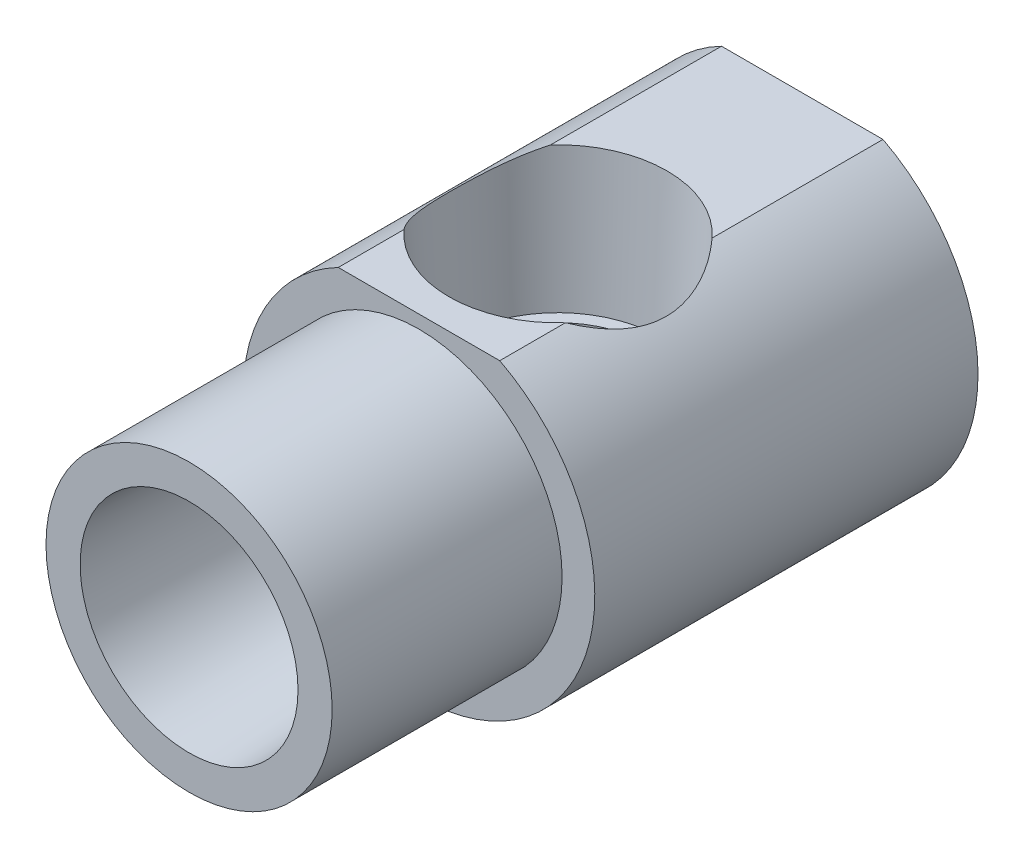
ISO-10303-21;
HEADER;
FILE_DESCRIPTION(('STEP AP214'),'2;1');
FILE_NAME('part.step','',(''),(''),'','','');
FILE_SCHEMA(('AUTOMOTIVE_DESIGN { 1 0 10303 214 1 1 1 1 }'));
ENDSEC;
DATA;
#1=APPLICATION_CONTEXT('core data for automotive mechanical design processes');
#2=APPLICATION_PROTOCOL_DEFINITION('international standard','automotive_design',2000,#1);
#3=PRODUCT_CONTEXT('',#1,'mechanical');
#4=PRODUCT('Part','Part','',(#3));
#5=PRODUCT_RELATED_PRODUCT_CATEGORY('part','',(#4));
#6=PRODUCT_DEFINITION_FORMATION('','',#4);
#7=PRODUCT_DEFINITION_CONTEXT('part definition',#1,'design');
#8=PRODUCT_DEFINITION('design','',#6,#7);
#9=PRODUCT_DEFINITION_SHAPE('','',#8);
#10=(LENGTH_UNIT() NAMED_UNIT(*) SI_UNIT(.MILLI.,.METRE.));
#11=(NAMED_UNIT(*) PLANE_ANGLE_UNIT() SI_UNIT($,.RADIAN.));
#12=(NAMED_UNIT(*) SI_UNIT($,.STERADIAN.) SOLID_ANGLE_UNIT());
#13=UNCERTAINTY_MEASURE_WITH_UNIT(LENGTH_MEASURE(1.E-05),#10,'distance_accuracy_value','');
#14=(GEOMETRIC_REPRESENTATION_CONTEXT(3) GLOBAL_UNCERTAINTY_ASSIGNED_CONTEXT((#13)) GLOBAL_UNIT_ASSIGNED_CONTEXT((#10,
#11,#12)) REPRESENTATION_CONTEXT('',''));
#15=CARTESIAN_POINT('',(0.,0.,0.));
#16=DIRECTION('',(0.,0.,1.));
#17=DIRECTION('',(1.,0.,0.));
#18=AXIS2_PLACEMENT_3D('',#15,#16,#17);
#19=CARTESIAN_POINT('',(-5.0165,9.70179425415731,0.));
#20=DIRECTION('',(0.,-1.,0.));
#21=DIRECTION('',(0.,0.,-1.));
#22=AXIS2_PLACEMENT_3D('',#19,#20,#21);
#23=PLANE('',#22);
#24=DIRECTION('',(0.,0.,-1.));
#25=VECTOR('',#24,1.);
#26=CARTESIAN_POINT('',(5.0165,9.70179425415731,0.));
#27=LINE('',#26,#25);
#28=CARTESIAN_POINT('',(5.0165,9.70179425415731,-15.875));
#29=VERTEX_POINT('',#28);
#30=CARTESIAN_POINT('',(5.0165,9.70179425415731,-19.9556639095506));
#31=VERTEX_POINT('',#30);
#32=EDGE_CURVE('E97',#29,#31,#27,.T.);
#33=ORIENTED_EDGE('',*,*,#32,.T.);
#34=CARTESIAN_POINT('',(0.,9.70179425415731,-24.511));
#35=DIRECTION('',(0.,-1.,0.));
#36=DIRECTION('',(0.,0.,-1.));
#37=AXIS2_PLACEMENT_3D('',#34,#35,#36);
#38=CIRCLE('',#37,6.77616109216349);
#39=CARTESIAN_POINT('',(-5.0165,9.70179425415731,-19.9556639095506));
#40=VERTEX_POINT('',#39);
#41=EDGE_CURVE('E11',#31,#40,#38,.T.);
#42=ORIENTED_EDGE('',*,*,#41,.T.);
#43=DIRECTION('',(0.,0.,-1.));
#44=VECTOR('',#43,1.);
#45=CARTESIAN_POINT('',(-5.0165,9.70179425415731,0.));
#46=LINE('',#45,#44);
#47=CARTESIAN_POINT('',(-5.0165,9.70179425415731,-15.875));
#48=VERTEX_POINT('',#47);
#49=EDGE_CURVE('E114',#48,#40,#46,.T.);
#50=ORIENTED_EDGE('',*,*,#49,.F.);
#51=DIRECTION('',(1.,0.,0.));
#52=VECTOR('',#51,1.);
#53=CARTESIAN_POINT('',(-8.89,9.70179425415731,-15.875));
#54=LINE('',#53,#52);
#55=EDGE_CURVE('E103',#48,#29,#54,.T.);
#56=ORIENTED_EDGE('',*,*,#55,.T.);
#57=EDGE_LOOP('',(#33,#42,#50,#56));
#58=FACE_BOUND('',#57,.T.);
#59=ADVANCED_FACE('F16',(#58),#23,.F.);
#60=CARTESIAN_POINT('',(-5.55625,0.,-13.462));
#61=DIRECTION('',(0.,0.,1.));
#62=DIRECTION('',(1.,0.,0.));
#63=AXIS2_PLACEMENT_3D('',#60,#61,#62);
#64=PLANE('',#63);
#65=CARTESIAN_POINT('',(0.,-0.00757924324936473,-13.462));
#66=DIRECTION('',(0.,0.,1.));
#67=DIRECTION('',(0.,1.,0.));
#68=AXIS2_PLACEMENT_3D('',#65,#66,#67);
#69=ELLIPSE('',#68,5.22919092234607,4.47866855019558);
#70=CARTESIAN_POINT('',(0.,5.22161167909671,-13.462));
#71=VERTEX_POINT('',#70);
#72=EDGE_CURVE('E117',#71,#71,#69,.F.);
#73=ORIENTED_EDGE('',*,*,#72,.T.);
#74=EDGE_LOOP('',(#73));
#75=FACE_BOUND('',#74,.T.);
#76=CARTESIAN_POINT('',(0.,0.,-13.462));
#77=DIRECTION('',(0.,0.,1.));
#78=DIRECTION('',(1.,0.,0.));
#79=AXIS2_PLACEMENT_3D('',#76,#77,#78);
#80=CIRCLE('',#79,6.14678382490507);
#81=CARTESIAN_POINT('',(6.14678382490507,0.,-13.462));
#82=VERTEX_POINT('',#81);
#83=EDGE_CURVE('E344',#82,#82,#80,.T.);
#84=ORIENTED_EDGE('',*,*,#83,.T.);
#85=EDGE_LOOP('',(#84));
#86=FACE_BOUND('',#85,.T.);
#87=ADVANCED_FACE('F294',(#75,#86),#64,.T.);
#88=CARTESIAN_POINT('',(-5.55625,0.,-1.5875));
#89=DIRECTION('',(0.,0.,1.));
#90=DIRECTION('',(1.,0.,0.));
#91=AXIS2_PLACEMENT_3D('',#88,#89,#90);
#92=PLANE('',#91);
#93=CARTESIAN_POINT('',(0.,0.,-1.58750000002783));
#94=DIRECTION('',(0.,0.,1.));
#95=DIRECTION('',(1.,0.,0.));
#96=AXIS2_PLACEMENT_3D('',#93,#94,#95);
#97=CIRCLE('',#96,6.7691);
#98=CARTESIAN_POINT('',(6.7691,0.,-1.58750000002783));
#99=VERTEX_POINT('',#98);
#100=EDGE_CURVE('E341',#99,#99,#97,.T.);
#101=ORIENTED_EDGE('',*,*,#100,.F.);
#102=EDGE_LOOP('',(#101));
#103=FACE_BOUND('',#102,.T.);
#104=CARTESIAN_POINT('',(0.,0.,-1.58750000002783));
#105=DIRECTION('',(0.,0.,1.));
#106=DIRECTION('',(1.,0.,0.));
#107=AXIS2_PLACEMENT_3D('',#104,#105,#106);
#108=CIRCLE('',#107,8.89);
#109=CARTESIAN_POINT('',(8.89,0.,-1.58750000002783));
#110=VERTEX_POINT('',#109);
#111=EDGE_CURVE('E346',#110,#110,#108,.F.);
#112=ORIENTED_EDGE('',*,*,#111,.F.);
#113=EDGE_LOOP('',(#112));
#114=FACE_BOUND('',#113,.T.);
#115=ADVANCED_FACE('F18',(#103,#114),#92,.T.);
#116=CARTESIAN_POINT('',(-10.922,0.,-39.6875));
#117=DIRECTION('',(0.,0.,-1.));
#118=DIRECTION('',(-1.,0.,0.));
#119=AXIS2_PLACEMENT_3D('',#116,#117,#118);
#120=PLANE('',#119);
#121=DIRECTION('',(1.,0.,0.));
#122=VECTOR('',#121,1.);
#123=CARTESIAN_POINT('',(-2.7496306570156,4.7625,-39.6875));
#124=LINE('',#123,#122);
#125=CARTESIAN_POINT('',(-2.7496306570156,4.7625,-39.6875));
#126=VERTEX_POINT('',#125);
#127=CARTESIAN_POINT('',(2.7496306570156,4.7625,-39.6875));
#128=VERTEX_POINT('',#127);
#129=EDGE_CURVE('E120',#126,#128,#124,.T.);
#130=ORIENTED_EDGE('',*,*,#129,.F.);
#131=DIRECTION('',(0.5,0.866025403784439,0.));
#132=VECTOR('',#131,1.);
#133=CARTESIAN_POINT('',(-5.49926131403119,0.,-39.6875));
#134=LINE('',#133,#132);
#135=CARTESIAN_POINT('',(-5.49926131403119,0.,-39.6875));
#136=VERTEX_POINT('',#135);
#137=EDGE_CURVE('E162',#136,#126,#134,.T.);
#138=ORIENTED_EDGE('',*,*,#137,.F.);
#139=DIRECTION('',(-0.5,0.866025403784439,0.));
#140=VECTOR('',#139,1.);
#141=CARTESIAN_POINT('',(-2.7496306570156,-4.7625,-39.6875));
#142=LINE('',#141,#140);
#143=CARTESIAN_POINT('',(-2.7496306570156,-4.7625,-39.6875));
#144=VERTEX_POINT('',#143);
#145=EDGE_CURVE('E188',#144,#136,#142,.T.);
#146=ORIENTED_EDGE('',*,*,#145,.F.);
#147=DIRECTION('',(-1.,0.,0.));
#148=VECTOR('',#147,1.);
#149=CARTESIAN_POINT('',(2.74963065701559,-4.7625,-39.6875));
#150=LINE('',#149,#148);
#151=CARTESIAN_POINT('',(2.74963065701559,-4.7625,-39.6875));
#152=VERTEX_POINT('',#151);
#153=EDGE_CURVE('E185',#152,#144,#150,.T.);
#154=ORIENTED_EDGE('',*,*,#153,.F.);
#155=DIRECTION('',(-0.5,-0.866025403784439,0.));
#156=VECTOR('',#155,1.);
#157=CARTESIAN_POINT('',(5.49926131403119,0.,-39.6875));
#158=LINE('',#157,#156);
#159=CARTESIAN_POINT('',(5.49926131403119,0.,-39.6875));
#160=VERTEX_POINT('',#159);
#161=EDGE_CURVE('E182',#160,#152,#158,.T.);
#162=ORIENTED_EDGE('',*,*,#161,.F.);
#163=DIRECTION('',(0.5,-0.866025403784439,0.));
#164=VECTOR('',#163,1.);
#165=CARTESIAN_POINT('',(2.7496306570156,4.7625,-39.6875));
#166=LINE('',#165,#164);
#167=EDGE_CURVE('E179',#128,#160,#166,.T.);
#168=ORIENTED_EDGE('',*,*,#167,.F.);
#169=EDGE_LOOP('',(#130,#138,#146,#154,#162,#168));
#170=FACE_BOUND('',#169,.T.);
#171=DIRECTION('',(-1.,0.,0.));
#172=VECTOR('',#171,1.);
#173=CARTESIAN_POINT('',(-5.0165,9.70179425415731,-39.6875));
#174=LINE('',#173,#172);
#175=CARTESIAN_POINT('',(5.0165,9.70179425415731,-39.6875));
#176=VERTEX_POINT('',#175);
#177=CARTESIAN_POINT('',(-5.0165,9.70179425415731,-39.6875));
#178=VERTEX_POINT('',#177);
#179=EDGE_CURVE('E95',#176,#178,#174,.T.);
#180=ORIENTED_EDGE('',*,*,#179,.F.);
#181=CARTESIAN_POINT('',(0.,0.,-39.6875));
#182=DIRECTION('',(0.,0.,-1.));
#183=DIRECTION('',(-1.,0.,0.));
#184=AXIS2_PLACEMENT_3D('',#181,#182,#183);
#185=CIRCLE('',#184,10.922);
#186=EDGE_CURVE('E20',#176,#178,#185,.T.);
#187=ORIENTED_EDGE('',*,*,#186,.T.);
#188=EDGE_LOOP('',(#180,#187));
#189=FACE_BOUND('',#188,.T.);
#190=ADVANCED_FACE('F100',(#170,#189),#120,.T.);
#191=CARTESIAN_POINT('',(0.,0.,-75.1971669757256));
#192=DIRECTION('',(0.,0.,-1.));
#193=DIRECTION('',(-1.,0.,0.));
#194=AXIS2_PLACEMENT_3D('',#191,#192,#193);
#195=CYLINDRICAL_SURFACE('',#194,10.922);
#196=CARTESIAN_POINT('',(5.01611318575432,9.70199425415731,-19.9552223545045));
#197=CARTESIAN_POINT('',(5.13874600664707,9.63860171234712,-20.0952157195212));
#198=CARTESIAN_POINT('',(5.25564164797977,9.57520664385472,-20.2402560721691));
#199=CARTESIAN_POINT('',(5.47752086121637,9.45002813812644,-20.5399810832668));
#200=CARTESIAN_POINT('',(5.58249714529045,9.38824570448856,-20.6946715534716));
#201=CARTESIAN_POINT('',(5.78097274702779,9.26736711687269,-21.0147255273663));
#202=CARTESIAN_POINT('',(5.87434183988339,9.20830544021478,-21.18018303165));
#203=CARTESIAN_POINT('',(6.0476637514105,9.09541327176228,-21.5196785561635));
#204=CARTESIAN_POINT('',(6.12761848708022,9.04158203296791,-21.693715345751));
#205=CARTESIAN_POINT('',(6.27379640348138,8.94077724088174,-22.050643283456));
#206=CARTESIAN_POINT('',(6.33993919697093,8.89384428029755,-22.2335790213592));
#207=CARTESIAN_POINT('',(6.45706504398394,8.80917858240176,-22.6062949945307));
#208=CARTESIAN_POINT('',(6.50805163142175,8.77144370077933,-22.7960736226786));
#209=CARTESIAN_POINT('',(6.59383346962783,8.70714156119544,-23.1801144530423));
#210=CARTESIAN_POINT('',(6.62870831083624,8.68051947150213,-23.3743495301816));
#211=CARTESIAN_POINT('',(6.6819385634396,8.63961377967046,-23.7663437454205));
#212=CARTESIAN_POINT('',(6.70029794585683,8.62532721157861,-23.9641020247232));
#213=CARTESIAN_POINT('',(6.71863048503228,8.61105017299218,-24.3315003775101));
#214=CARTESIAN_POINT('',(6.72092722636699,8.6092532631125,-24.5009594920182));
#215=CARTESIAN_POINT('',(6.71322085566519,8.61526418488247,-24.8394147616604));
#216=CARTESIAN_POINT('',(6.70321892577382,8.6230710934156,-25.0084109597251));
#217=CARTESIAN_POINT('',(6.67106070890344,8.64797346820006,-25.3447526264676));
#218=CARTESIAN_POINT('',(6.64888985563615,8.66508006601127,-25.5120958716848));
#219=CARTESIAN_POINT('',(6.59274566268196,8.70787088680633,-25.8436318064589));
#220=CARTESIAN_POINT('',(6.55877214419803,8.73355523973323,-26.0078244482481));
#221=CARTESIAN_POINT('',(6.44503992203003,8.8181720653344,-26.4726969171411));
#222=CARTESIAN_POINT('',(6.35112179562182,8.88662503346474,-26.7683027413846));
#223=CARTESIAN_POINT('',(6.12702756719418,9.04257250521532,-27.3398699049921));
#224=CARTESIAN_POINT('',(5.99683851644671,9.13007380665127,-27.6158241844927));
#225=CARTESIAN_POINT('',(5.73165005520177,9.2982747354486,-28.0939447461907));
#226=CARTESIAN_POINT('',(5.60244827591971,9.37701803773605,-28.3000612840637));
#227=CARTESIAN_POINT('',(5.32402625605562,9.53785679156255,-28.6958216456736));
#228=CARTESIAN_POINT('',(5.17487070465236,9.61994083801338,-28.8855155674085));
#229=CARTESIAN_POINT('',(5.01611318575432,9.70199425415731,-29.0667776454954));
#230=B_SPLINE_CURVE_WITH_KNOTS('',3,(#196,#197,#198,#199,#200,#201,#202,#203,#204,#205,#206,
#207,#208,#209,#210,#211,#212,#213,#214,#215,#216,#217,#218,#219,#220,#221,#222,#223,#224,#225,
#226,#227,#228,#229),.UNSPECIFIED.,.F.,.F.,(4,2,2,2,2,2,2,2,2,2,2,2,2,2,2,2,4),(0.,
0.589708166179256,1.17977497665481,1.77595731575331,2.37205438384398,2.97152964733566,
3.57086502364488,4.16720722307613,4.76340599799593,5.27115701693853,5.77885923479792,
6.28717050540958,6.79548947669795,7.74447500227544,8.69379975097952,9.45956340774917,
10.222902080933),.UNSPECIFIED.);
#231=CARTESIAN_POINT('',(5.0165,9.70179425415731,-29.0663360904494));
#232=VERTEX_POINT('',#231);
#233=EDGE_CURVE('E35',#31,#232,#230,.T.);
#234=ORIENTED_EDGE('',*,*,#233,.F.);
#235=ORIENTED_EDGE('',*,*,#32,.F.);
#236=CARTESIAN_POINT('',(0.,0.,-15.875));
#237=DIRECTION('',(0.,0.,-1.));
#238=DIRECTION('',(-1.,0.,0.));
#239=AXIS2_PLACEMENT_3D('',#236,#237,#238);
#240=CIRCLE('',#239,10.922);
#241=EDGE_CURVE('E104',#29,#48,#240,.T.);
#242=ORIENTED_EDGE('',*,*,#241,.T.);
#243=ORIENTED_EDGE('',*,*,#49,.T.);
#244=CARTESIAN_POINT('',(-5.01611318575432,9.70199425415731,-29.0667776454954));
#245=CARTESIAN_POINT('',(-5.13874600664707,9.63860171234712,-28.9267842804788));
#246=CARTESIAN_POINT('',(-5.25564164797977,9.57520664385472,-28.7817439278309));
#247=CARTESIAN_POINT('',(-5.47752086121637,9.45002813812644,-28.4820189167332));
#248=CARTESIAN_POINT('',(-5.58249714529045,9.38824570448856,-28.3273284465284));
#249=CARTESIAN_POINT('',(-5.78097274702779,9.26736711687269,-28.0072744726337));
#250=CARTESIAN_POINT('',(-5.87434183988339,9.20830544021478,-27.84181696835));
#251=CARTESIAN_POINT('',(-6.0476637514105,9.09541327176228,-27.5023214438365));
#252=CARTESIAN_POINT('',(-6.12761848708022,9.04158203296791,-27.328284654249));
#253=CARTESIAN_POINT('',(-6.27379640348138,8.94077724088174,-26.971356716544));
#254=CARTESIAN_POINT('',(-6.33993919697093,8.89384428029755,-26.7884209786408));
#255=CARTESIAN_POINT('',(-6.45706504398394,8.80917858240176,-26.4157050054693));
#256=CARTESIAN_POINT('',(-6.50805163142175,8.77144370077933,-26.2259263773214));
#257=CARTESIAN_POINT('',(-6.59383346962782,8.70714156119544,-25.8418855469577));
#258=CARTESIAN_POINT('',(-6.62870831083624,8.68051947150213,-25.6476504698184));
#259=CARTESIAN_POINT('',(-6.6819385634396,8.63961377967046,-25.2556562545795));
#260=CARTESIAN_POINT('',(-6.70029794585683,8.62532721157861,-25.0578979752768));
#261=CARTESIAN_POINT('',(-6.71863048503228,8.61105017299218,-24.6904996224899));
#262=CARTESIAN_POINT('',(-6.72092722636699,8.6092532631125,-24.5210405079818));
#263=CARTESIAN_POINT('',(-6.71322085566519,8.61526418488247,-24.1825852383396));
#264=CARTESIAN_POINT('',(-6.70321892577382,8.62307109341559,-24.0135890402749));
#265=CARTESIAN_POINT('',(-6.67106070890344,8.64797346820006,-23.6772473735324));
#266=CARTESIAN_POINT('',(-6.64888985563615,8.66508006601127,-23.5099041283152));
#267=CARTESIAN_POINT('',(-6.59274566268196,8.70787088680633,-23.1783681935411));
#268=CARTESIAN_POINT('',(-6.55877214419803,8.73355523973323,-23.0141755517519));
#269=CARTESIAN_POINT('',(-6.44503992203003,8.8181720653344,-22.5493030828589));
#270=CARTESIAN_POINT('',(-6.35112179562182,8.88662503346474,-22.2536972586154));
#271=CARTESIAN_POINT('',(-6.12702756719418,9.04257250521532,-21.6821300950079));
#272=CARTESIAN_POINT('',(-5.99683851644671,9.13007380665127,-21.4061758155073));
#273=CARTESIAN_POINT('',(-5.73165005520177,9.2982747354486,-20.9280552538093));
#274=CARTESIAN_POINT('',(-5.6024482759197,9.37701803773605,-20.7219387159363));
#275=CARTESIAN_POINT('',(-5.32402625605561,9.53785679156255,-20.3261783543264));
#276=CARTESIAN_POINT('',(-5.17487070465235,9.61994083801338,-20.1364844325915));
#277=CARTESIAN_POINT('',(-5.01611318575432,9.70199425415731,-19.9552223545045));
#278=B_SPLINE_CURVE_WITH_KNOTS('',3,(#244,#245,#246,#247,#248,#249,#250,#251,#252,#253,#254,
#255,#256,#257,#258,#259,#260,#261,#262,#263,#264,#265,#266,#267,#268,#269,#270,#271,#272,#273,
#274,#275,#276,#277),.UNSPECIFIED.,.F.,.F.,(4,2,2,2,2,2,2,2,2,2,2,2,2,2,2,2,4),(0.,
0.589708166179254,1.1797749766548,1.77595731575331,2.37205438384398,2.97152964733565,
3.57086502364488,4.16720722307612,4.76340599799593,5.27115701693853,5.77885923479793,
6.28717050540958,6.79548947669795,7.74447500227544,8.69379975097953,9.45956340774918,
10.222902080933),.UNSPECIFIED.);
#279=CARTESIAN_POINT('',(-5.0165,9.70179425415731,-29.0663360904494));
#280=VERTEX_POINT('',#279);
#281=EDGE_CURVE('E259',#280,#40,#278,.T.);
#282=ORIENTED_EDGE('',*,*,#281,.F.);
#283=EDGE_CURVE('E85',#280,#178,#46,.T.);
#284=ORIENTED_EDGE('',*,*,#283,.T.);
#285=ORIENTED_EDGE('',*,*,#186,.F.);
#286=EDGE_CURVE('E92',#232,#176,#27,.T.);
#287=ORIENTED_EDGE('',*,*,#286,.F.);
#288=EDGE_LOOP('',(#234,#235,#242,#243,#282,#284,#285,#287));
#289=FACE_BOUND('',#288,.T.);
#290=ADVANCED_FACE('F102',(#289),#195,.T.);
#291=CARTESIAN_POINT('',(-8.89,0.,-15.875));
#292=DIRECTION('',(0.,0.,1.));
#293=DIRECTION('',(1.,0.,0.));
#294=AXIS2_PLACEMENT_3D('',#291,#292,#293);
#295=PLANE('',#294);
#296=ORIENTED_EDGE('',*,*,#55,.F.);
#297=ORIENTED_EDGE('',*,*,#241,.F.);
#298=EDGE_LOOP('',(#296,#297));
#299=FACE_BOUND('',#298,.T.);
#300=CARTESIAN_POINT('',(0.,0.,-15.875));
#301=DIRECTION('',(0.,0.,-1.));
#302=DIRECTION('',(-1.,0.,0.));
#303=AXIS2_PLACEMENT_3D('',#300,#301,#302);
#304=CIRCLE('',#303,8.89);
#305=CARTESIAN_POINT('',(-8.89,0.,-15.875));
#306=VERTEX_POINT('',#305);
#307=EDGE_CURVE('E108',#306,#306,#304,.T.);
#308=ORIENTED_EDGE('',*,*,#307,.T.);
#309=EDGE_LOOP('',(#308));
#310=FACE_BOUND('',#309,.T.);
#311=ADVANCED_FACE('F224',(#299,#310),#295,.T.);
#312=CARTESIAN_POINT('',(0.,0.,-75.1971669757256));
#313=DIRECTION('',(0.,0.,-1.));
#314=DIRECTION('',(-1.,0.,0.));
#315=AXIS2_PLACEMENT_3D('',#312,#313,#314);
#316=CYLINDRICAL_SURFACE('',#315,8.89);
#317=ORIENTED_EDGE('',*,*,#307,.F.);
#318=EDGE_LOOP('',(#317));
#319=FACE_BOUND('',#318,.T.);
#320=ORIENTED_EDGE('',*,*,#111,.T.);
#321=EDGE_LOOP('',(#320));
#322=FACE_BOUND('',#321,.T.);
#323=ADVANCED_FACE('F304',(#319,#322),#316,.T.);
#324=ORIENTED_EDGE('',*,*,#283,.F.);
#325=EDGE_CURVE('E26',#280,#232,#38,.T.);
#326=ORIENTED_EDGE('',*,*,#325,.T.);
#327=ORIENTED_EDGE('',*,*,#286,.T.);
#328=ORIENTED_EDGE('',*,*,#179,.T.);
#329=EDGE_LOOP('',(#324,#326,#327,#328));
#330=FACE_BOUND('',#329,.T.);
#331=ADVANCED_FACE('F94',(#330),#23,.F.);
#332=CARTESIAN_POINT('',(-2.7496306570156,4.7625,-34.925));
#333=DIRECTION('',(0.,1.,0.));
#334=DIRECTION('',(0.,0.,1.));
#335=AXIS2_PLACEMENT_3D('',#332,#333,#334);
#336=PLANE('',#335);
#337=ORIENTED_EDGE('',*,*,#129,.T.);
#338=DIRECTION('',(0.,0.,-1.));
#339=VECTOR('',#338,1.);
#340=CARTESIAN_POINT('',(2.7496306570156,4.7625,-34.925));
#341=LINE('',#340,#339);
#342=CARTESIAN_POINT('',(2.7496306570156,4.7625,-33.3375));
#343=VERTEX_POINT('',#342);
#344=EDGE_CURVE('E166',#343,#128,#341,.T.);
#345=ORIENTED_EDGE('',*,*,#344,.F.);
#346=DIRECTION('',(1.,0.,0.));
#347=VECTOR('',#346,1.);
#348=CARTESIAN_POINT('',(-2.7496306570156,4.7625,-33.3375));
#349=LINE('',#348,#347);
#350=CARTESIAN_POINT('',(-2.7496306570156,4.7625,-33.3375));
#351=VERTEX_POINT('',#350);
#352=EDGE_CURVE('E158',#351,#343,#349,.T.);
#353=ORIENTED_EDGE('',*,*,#352,.F.);
#354=DIRECTION('',(0.,0.,-1.));
#355=VECTOR('',#354,1.);
#356=CARTESIAN_POINT('',(-2.7496306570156,4.7625,-34.925));
#357=LINE('',#356,#355);
#358=EDGE_CURVE('E101',#351,#126,#357,.T.);
#359=ORIENTED_EDGE('',*,*,#358,.T.);
#360=EDGE_LOOP('',(#337,#345,#353,#359));
#361=FACE_BOUND('',#360,.T.);
#362=ADVANCED_FACE('F205',(#361),#336,.F.);
#363=CARTESIAN_POINT('',(-5.49926131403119,0.,-34.925));
#364=DIRECTION('',(-0.866025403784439,0.5,0.));
#365=DIRECTION('',(-0.5,-0.866025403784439,0.));
#366=AXIS2_PLACEMENT_3D('',#363,#364,#365);
#367=PLANE('',#366);
#368=ORIENTED_EDGE('',*,*,#137,.T.);
#369=ORIENTED_EDGE('',*,*,#358,.F.);
#370=DIRECTION('',(0.5,0.866025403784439,0.));
#371=VECTOR('',#370,1.);
#372=CARTESIAN_POINT('',(-5.49926131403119,0.,-33.3375));
#373=LINE('',#372,#371);
#374=CARTESIAN_POINT('',(-5.49926131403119,0.,-33.3375));
#375=VERTEX_POINT('',#374);
#376=EDGE_CURVE('E163',#375,#351,#373,.T.);
#377=ORIENTED_EDGE('',*,*,#376,.F.);
#378=DIRECTION('',(0.,0.,-1.));
#379=VECTOR('',#378,1.);
#380=CARTESIAN_POINT('',(-5.49926131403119,0.,-34.925));
#381=LINE('',#380,#379);
#382=EDGE_CURVE('E198',#375,#136,#381,.T.);
#383=ORIENTED_EDGE('',*,*,#382,.T.);
#384=EDGE_LOOP('',(#368,#369,#377,#383));
#385=FACE_BOUND('',#384,.T.);
#386=ADVANCED_FACE('F195',(#385),#367,.F.);
#387=CARTESIAN_POINT('',(-2.7496306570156,-4.7625,-34.925));
#388=DIRECTION('',(-0.866025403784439,-0.5,0.));
#389=DIRECTION('',(0.5,-0.866025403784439,0.));
#390=AXIS2_PLACEMENT_3D('',#387,#388,#389);
#391=PLANE('',#390);
#392=ORIENTED_EDGE('',*,*,#145,.T.);
#393=ORIENTED_EDGE('',*,*,#382,.F.);
#394=DIRECTION('',(-0.5,0.866025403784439,0.));
#395=VECTOR('',#394,1.);
#396=CARTESIAN_POINT('',(-2.7496306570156,-4.7625,-33.3375));
#397=LINE('',#396,#395);
#398=CARTESIAN_POINT('',(-2.7496306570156,-4.7625,-33.3375));
#399=VERTEX_POINT('',#398);
#400=EDGE_CURVE('E167',#399,#375,#397,.T.);
#401=ORIENTED_EDGE('',*,*,#400,.F.);
#402=DIRECTION('',(0.,0.,-1.));
#403=VECTOR('',#402,1.);
#404=CARTESIAN_POINT('',(-2.7496306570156,-4.7625,-34.925));
#405=LINE('',#404,#403);
#406=EDGE_CURVE('E269',#399,#144,#405,.T.);
#407=ORIENTED_EDGE('',*,*,#406,.T.);
#408=EDGE_LOOP('',(#392,#393,#401,#407));
#409=FACE_BOUND('',#408,.T.);
#410=ADVANCED_FACE('F278',(#409),#391,.F.);
#411=CARTESIAN_POINT('',(2.74963065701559,-4.7625,-34.925));
#412=DIRECTION('',(0.,-1.,0.));
#413=DIRECTION('',(1.,0.,0.));
#414=AXIS2_PLACEMENT_3D('',#411,#412,#413);
#415=PLANE('',#414);
#416=ORIENTED_EDGE('',*,*,#153,.T.);
#417=ORIENTED_EDGE('',*,*,#406,.F.);
#418=DIRECTION('',(-1.,0.,0.));
#419=VECTOR('',#418,1.);
#420=CARTESIAN_POINT('',(2.74963065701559,-4.7625,-33.3375));
#421=LINE('',#420,#419);
#422=CARTESIAN_POINT('',(2.74963065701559,-4.7625,-33.3375));
#423=VERTEX_POINT('',#422);
#424=EDGE_CURVE('E170',#423,#399,#421,.T.);
#425=ORIENTED_EDGE('',*,*,#424,.F.);
#426=DIRECTION('',(0.,0.,-1.));
#427=VECTOR('',#426,1.);
#428=CARTESIAN_POINT('',(2.74963065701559,-4.7625,-34.925));
#429=LINE('',#428,#427);
#430=EDGE_CURVE('E211',#423,#152,#429,.T.);
#431=ORIENTED_EDGE('',*,*,#430,.T.);
#432=EDGE_LOOP('',(#416,#417,#425,#431));
#433=FACE_BOUND('',#432,.T.);
#434=ADVANCED_FACE('F272',(#433),#415,.F.);
#435=CARTESIAN_POINT('',(5.49926131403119,0.,-34.925));
#436=DIRECTION('',(0.866025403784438,-0.5,0.));
#437=DIRECTION('',(0.5,0.866025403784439,0.));
#438=AXIS2_PLACEMENT_3D('',#435,#436,#437);
#439=PLANE('',#438);
#440=ORIENTED_EDGE('',*,*,#161,.T.);
#441=ORIENTED_EDGE('',*,*,#430,.F.);
#442=DIRECTION('',(-0.5,-0.866025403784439,0.));
#443=VECTOR('',#442,1.);
#444=CARTESIAN_POINT('',(5.49926131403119,0.,-33.3375));
#445=LINE('',#444,#443);
#446=CARTESIAN_POINT('',(5.49926131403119,0.,-33.3375));
#447=VERTEX_POINT('',#446);
#448=EDGE_CURVE('E173',#447,#423,#445,.T.);
#449=ORIENTED_EDGE('',*,*,#448,.F.);
#450=DIRECTION('',(0.,0.,-1.));
#451=VECTOR('',#450,1.);
#452=CARTESIAN_POINT('',(5.49926131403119,0.,-34.925));
#453=LINE('',#452,#451);
#454=EDGE_CURVE('E209',#447,#160,#453,.T.);
#455=ORIENTED_EDGE('',*,*,#454,.T.);
#456=EDGE_LOOP('',(#440,#441,#449,#455));
#457=FACE_BOUND('',#456,.T.);
#458=ADVANCED_FACE('F276',(#457),#439,.F.);
#459=CARTESIAN_POINT('',(2.7496306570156,4.7625,-34.925));
#460=DIRECTION('',(0.866025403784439,0.5,0.));
#461=DIRECTION('',(-0.5,0.866025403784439,0.));
#462=AXIS2_PLACEMENT_3D('',#459,#460,#461);
#463=PLANE('',#462);
#464=ORIENTED_EDGE('',*,*,#167,.T.);
#465=ORIENTED_EDGE('',*,*,#454,.F.);
#466=DIRECTION('',(0.5,-0.866025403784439,0.));
#467=VECTOR('',#466,1.);
#468=CARTESIAN_POINT('',(2.7496306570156,4.7625,-33.3375));
#469=LINE('',#468,#467);
#470=EDGE_CURVE('E161',#343,#447,#469,.T.);
#471=ORIENTED_EDGE('',*,*,#470,.F.);
#472=ORIENTED_EDGE('',*,*,#344,.T.);
#473=EDGE_LOOP('',(#464,#465,#471,#472));
#474=FACE_BOUND('',#473,.T.);
#475=ADVANCED_FACE('F208',(#474),#463,.F.);
#476=CARTESIAN_POINT('',(0.,0.,-33.3375));
#477=DIRECTION('',(0.,0.,-1.));
#478=DIRECTION('',(-1.,0.,0.));
#479=AXIS2_PLACEMENT_3D('',#476,#477,#478);
#480=PLANE('',#479);
#481=ORIENTED_EDGE('',*,*,#352,.T.);
#482=ORIENTED_EDGE('',*,*,#470,.T.);
#483=ORIENTED_EDGE('',*,*,#448,.T.);
#484=ORIENTED_EDGE('',*,*,#424,.T.);
#485=ORIENTED_EDGE('',*,*,#400,.T.);
#486=ORIENTED_EDGE('',*,*,#376,.T.);
#487=EDGE_LOOP('',(#481,#482,#483,#484,#485,#486));
#488=FACE_BOUND('',#487,.T.);
#489=ADVANCED_FACE('F281',(#488),#480,.T.);
#490=CARTESIAN_POINT('',(0.,-6.20347480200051,-22.845096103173));
#491=DIRECTION('',(0.,0.499512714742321,0.866306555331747));
#492=DIRECTION('',(0.,-0.866306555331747,0.499512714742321));
#493=AXIS2_PLACEMENT_3D('',#490,#491,#492);
#494=CONICAL_SURFACE('',#493,1.6057813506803,1.04663497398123);
#495=CARTESIAN_POINT('',(-1.60598135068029,-4.92366652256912,-23.2674837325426));
#496=CARTESIAN_POINT('',(-1.54801586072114,-4.95680342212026,-23.2864056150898));
#497=CARTESIAN_POINT('',(-1.48993744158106,-4.98980230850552,-23.305231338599));
#498=CARTESIAN_POINT('',(-1.37340604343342,-5.05537021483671,-23.3425949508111));
#499=CARTESIAN_POINT('',(-1.31495289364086,-5.08793901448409,-23.3611326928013));
#500=CARTESIAN_POINT('',(-1.19585116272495,-5.15341039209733,-23.3983462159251));
#501=CARTESIAN_POINT('',(-1.13518864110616,-5.18629452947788,-23.4170099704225));
#502=CARTESIAN_POINT('',(-1.01316854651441,-5.25107049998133,-23.4537085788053));
#503=CARTESIAN_POINT('',(-0.951811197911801,-5.28296264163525,-23.4717436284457));
#504=CARTESIAN_POINT('',(-0.83911893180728,-5.3396112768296,-23.5037077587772));
#505=CARTESIAN_POINT('',(-0.787957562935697,-5.36462261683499,-23.5177936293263));
#506=CARTESIAN_POINT('',(-0.684623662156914,-5.41302356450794,-23.5449938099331));
#507=CARTESIAN_POINT('',(-0.632451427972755,-5.43641364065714,-23.5581084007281));
#508=CARTESIAN_POINT('',(-0.527211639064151,-5.48038053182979,-23.5827010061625));
#509=CARTESIAN_POINT('',(-0.474159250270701,-5.50098432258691,-23.5941947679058));
#510=CARTESIAN_POINT('',(-0.366152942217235,-5.53798897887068,-23.6147880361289));
#511=CARTESIAN_POINT('',(-0.311202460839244,-5.55439703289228,-23.6238916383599));
#512=CARTESIAN_POINT('',(-0.224404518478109,-5.57453509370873,-23.6350449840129));
#513=CARTESIAN_POINT('',(-0.193292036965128,-5.58064728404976,-23.6384253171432));
#514=CARTESIAN_POINT('',(-0.130548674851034,-5.59030484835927,-23.6437629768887));
#515=CARTESIAN_POINT('',(-0.0989180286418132,-5.59385135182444,-23.6457209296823));
#516=CARTESIAN_POINT('',(-0.0355632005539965,-5.59800285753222,-23.6480125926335));
#517=CARTESIAN_POINT('',(-0.00384036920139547,-5.59862312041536,-23.6483547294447));
#518=CARTESIAN_POINT('',(0.0594996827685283,-5.5968978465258,-23.6474026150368));
#519=CARTESIAN_POINT('',(0.0911168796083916,-5.59455168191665,-23.6461080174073));
#520=CARTESIAN_POINT('',(0.198837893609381,-5.58181842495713,-23.6390746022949));
#521=CARTESIAN_POINT('',(0.273911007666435,-5.56473069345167,-23.6296279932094));
#522=CARTESIAN_POINT('',(0.384150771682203,-5.53190562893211,-23.6114021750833));
#523=CARTESIAN_POINT('',(0.42088805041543,-5.51959035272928,-23.6045534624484));
#524=CARTESIAN_POINT('',(0.493546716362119,-5.49323102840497,-23.5898668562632));
#525=CARTESIAN_POINT('',(0.529468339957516,-5.47918748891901,-23.5820292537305));
#526=CARTESIAN_POINT('',(0.612782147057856,-5.44486829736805,-23.5628416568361));
#527=CARTESIAN_POINT('',(0.659900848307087,-5.42410253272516,-23.5512064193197));
#528=CARTESIAN_POINT('',(0.753260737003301,-5.38113317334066,-23.5270791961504));
#529=CARTESIAN_POINT('',(0.799501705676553,-5.35892922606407,-23.5145870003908));
#530=CARTESIAN_POINT('',(0.937391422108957,-5.29083562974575,-23.4762074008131));
#531=CARTESIAN_POINT('',(1.02808532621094,-5.24351779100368,-23.449446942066));
#532=CARTESIAN_POINT('',(1.20042119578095,-5.1511102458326,-23.39704965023));
#533=CARTESIAN_POINT('',(1.28217710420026,-5.1061732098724,-23.3715107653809));
#534=CARTESIAN_POINT('',(1.4041288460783,-5.03811359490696,-23.3327633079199));
#535=CARTESIAN_POINT('',(1.44460336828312,-5.01535392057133,-23.3197947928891));
#536=CARTESIAN_POINT('',(1.52539869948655,-4.96964276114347,-23.2937288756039));
#537=CARTESIAN_POINT('',(1.56571951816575,-4.94669128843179,-23.2806314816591));
#538=CARTESIAN_POINT('',(1.60598135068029,-4.92366652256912,-23.2674837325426));
#539=B_SPLINE_CURVE_WITH_KNOTS('',3,(#495,#496,#497,#498,#499,#500,#501,#502,#503,#504,#505,
#506,#507,#508,#509,#510,#511,#512,#513,#514,#515,#516,#517,#518,#519,#520,#521,#522,#523,#524,
#525,#526,#527,#528,#529,#530,#531,#532,#533,#534,#535,#536,#537,#538),.UNSPECIFIED.,.F.,.F.,(4,
2,2,2,2,2,2,2,2,2,2,2,2,2,2,2,2,2,2,2,2,4),(0.,0.208197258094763,0.416497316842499,
0.630934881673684,0.845305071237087,1.02127406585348,1.19719199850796,1.37126163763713,
1.54503101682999,1.64057868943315,1.7360842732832,1.83109123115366,1.9261183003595,
2.15701869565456,2.27506343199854,2.3930735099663,2.55139683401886,2.70975911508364,
3.02689190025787,3.3170580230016,3.46169224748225,3.60631720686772),.UNSPECIFIED.);
#540=CARTESIAN_POINT('',(-1.11098322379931,-5.19906341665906,-23.4242401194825));
#541=VERTEX_POINT('',#540);
#542=CARTESIAN_POINT('',(1.11098322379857,-5.19906341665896,-23.4242401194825));
#543=VERTEX_POINT('',#542);
#544=EDGE_CURVE('E251',#541,#543,#539,.T.);
#545=ORIENTED_EDGE('',*,*,#544,.F.);
#546=CARTESIAN_POINT('',(0.,-6.20347480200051,-22.845096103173));
#547=DIRECTION('',(0.,-0.499512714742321,-0.866306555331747));
#548=DIRECTION('',(0.,0.866306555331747,-0.499512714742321));
#549=AXIS2_PLACEMENT_3D('',#546,#547,#548);
#550=CIRCLE('',#549,1.6057813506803);
#551=EDGE_CURVE('E121',#543,#541,#550,.T.);
#552=ORIENTED_EDGE('',*,*,#551,.F.);
#553=EDGE_LOOP('',(#545,#552));
#554=FACE_BOUND('',#553,.T.);
#555=CARTESIAN_POINT('',(0.,-6.66717404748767,-23.6492912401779));
#556=VERTEX_POINT('',#555);
#557=VERTEX_LOOP('',#556);
#558=FACE_BOUND('',#557,.T.);
#559=ADVANCED_FACE('F283',(#554,#558),#494,.F.);
#560=CARTESIAN_POINT('',(0.,0.737834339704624,-10.8067606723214));
#561=DIRECTION('',(0.,0.499512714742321,0.866306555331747));
#562=DIRECTION('',(0.,-0.866306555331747,0.499512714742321));
#563=AXIS2_PLACEMENT_3D('',#560,#561,#562);
#564=CONICAL_SURFACE('',#563,5.22642714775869,0.254883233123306);
#565=CARTESIAN_POINT('',(1.01196113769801,-5.32825795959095,-23.6474043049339));
#566=CARTESIAN_POINT('',(1.03389680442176,-5.30065791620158,-23.5994787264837));
#567=CARTESIAN_POINT('',(1.05540462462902,-5.27289731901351,-23.5514528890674));
#568=CARTESIAN_POINT('',(1.09769940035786,-5.21711231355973,-23.4552409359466));
#569=CARTESIAN_POINT('',(1.11848639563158,-5.18908791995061,-23.4070548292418));
#570=CARTESIAN_POINT('',(1.17996400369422,-5.10471123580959,-23.26232712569));
#571=CARTESIAN_POINT('',(1.21977960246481,-5.04804474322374,-23.1655976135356));
#572=CARTESIAN_POINT('',(1.29773817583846,-4.93416916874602,-22.9718471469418));
#573=CARTESIAN_POINT('',(1.33588180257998,-4.8769603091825,-22.874826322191));
#574=CARTESIAN_POINT('',(1.41092804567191,-4.76213227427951,-22.6805403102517));
#575=CARTESIAN_POINT('',(1.44783058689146,-4.70451307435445,-22.5832751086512));
#576=CARTESIAN_POINT('',(1.57544445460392,-4.5021837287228,-22.2422894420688));
#577=CARTESIAN_POINT('',(1.66369168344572,-4.3567012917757,-21.9981071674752));
#578=CARTESIAN_POINT('',(1.83681407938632,-4.06477004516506,-21.509128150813));
#579=CARTESIAN_POINT('',(1.92168912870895,-3.91832120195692,-21.2643313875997));
#580=CARTESIAN_POINT('',(2.08932287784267,-3.624688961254,-20.7741002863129));
#581=CARTESIAN_POINT('',(2.17207941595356,-3.47750498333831,-20.5286655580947));
#582=CARTESIAN_POINT('',(2.33601111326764,-3.18275206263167,-20.0375426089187));
#583=CARTESIAN_POINT('',(2.41718646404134,-3.03518316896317,-19.7918544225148));
#584=CARTESIAN_POINT('',(2.4978920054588,-2.88750711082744,-19.5460816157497));
#585=B_SPLINE_CURVE_WITH_KNOTS('',3,(#565,#566,#567,#568,#569,#570,#571,#572,#573,#574,#575,
#576,#577,#578,#579,#580,#581,#582,#583,#584),.UNSPECIFIED.,.F.,.F.,(4,2,2,2,2,2,2,2,2,4),(0.,
0.178483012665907,0.356956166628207,0.713833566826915,1.07057050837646,1.42732900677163,
2.32014264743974,3.21298744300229,4.10670963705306,5.00032286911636),.UNSPECIFIED.);
#586=CARTESIAN_POINT('',(2.49778278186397,-2.88770711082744,-19.5464144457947));
#587=VERTEX_POINT('',#586);
#588=EDGE_CURVE('E152',#543,#587,#585,.T.);
#589=ORIENTED_EDGE('',*,*,#588,.F.);
#590=ORIENTED_EDGE('',*,*,#551,.T.);
#591=CARTESIAN_POINT('',(-2.49789200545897,-2.88750711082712,-19.5460816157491));
#592=CARTESIAN_POINT('',(-2.44770652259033,-2.97939053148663,-19.6989913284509));
#593=CARTESIAN_POINT('',(-2.39731483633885,-3.07122429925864,-19.8518636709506));
#594=CARTESIAN_POINT('',(-2.29600007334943,-3.25476046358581,-20.1575157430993));
#595=CARTESIAN_POINT('',(-2.24507698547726,-3.34646285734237,-20.3102954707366));
#596=CARTESIAN_POINT('',(-2.1425420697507,-3.52977268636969,-20.6158586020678));
#597=CARTESIAN_POINT('',(-2.09092972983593,-3.6213799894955,-20.7686419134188));
#598=CARTESIAN_POINT('',(-1.98688424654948,-3.80437404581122,-21.0740585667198));
#599=CARTESIAN_POINT('',(-1.93445111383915,-3.89576080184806,-21.2266919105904));
#600=CARTESIAN_POINT('',(-1.82863256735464,-4.07804970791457,-21.5314497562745));
#601=CARTESIAN_POINT('',(-1.77524935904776,-4.16895247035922,-21.6835746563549));
#602=CARTESIAN_POINT('',(-1.66707377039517,-4.35034813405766,-21.9875672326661));
#603=CARTESIAN_POINT('',(-1.61228140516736,-4.44084103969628,-22.1394349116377));
#604=CARTESIAN_POINT('',(-1.50075171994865,-4.62119778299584,-22.4427597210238));
#605=CARTESIAN_POINT('',(-1.44401501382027,-4.71106180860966,-22.5942169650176));
#606=CARTESIAN_POINT('',(-1.32768795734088,-4.88985939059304,-22.8965806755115));
#607=CARTESIAN_POINT('',(-1.2680978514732,-4.97879302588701,-23.047487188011));
#608=CARTESIAN_POINT('',(-1.19073480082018,-5.08895406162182,-23.2355249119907));
#609=CARTESIAN_POINT('',(-1.17511873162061,-5.11093553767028,-23.2731019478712));
#610=CARTESIAN_POINT('',(-1.14355086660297,-5.15477909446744,-23.3481852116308));
#611=CARTESIAN_POINT('',(-1.12759906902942,-5.17664117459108,-23.3856914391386));
#612=CARTESIAN_POINT('',(-1.07914810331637,-5.24202332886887,-23.498097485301));
#613=CARTESIAN_POINT('',(-1.04606024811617,-5.28532942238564,-23.5728677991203));
#614=CARTESIAN_POINT('',(-1.01196113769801,-5.32825795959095,-23.6474043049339));
#615=B_SPLINE_CURVE_WITH_KNOTS('',3,(#591,#592,#593,#594,#595,#596,#597,#598,#599,#600,#601,
#602,#603,#604,#605,#606,#607,#608,#609,#610,#611,#612,#613,#614),.UNSPECIFIED.,.F.,.F.,(4,2,2,
2,2,2,2,2,2,2,2,4),(0.,0.55595255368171,1.1119167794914,1.6683199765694,2.22471595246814,
2.77995563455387,3.33518936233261,3.89024937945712,4.44526192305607,4.58401142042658,
4.72276164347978,5.00032427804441),.UNSPECIFIED.);
#616=CARTESIAN_POINT('',(-2.49778278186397,-2.88770711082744,-19.5464144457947));
#617=VERTEX_POINT('',#616);
#618=EDGE_CURVE('E129',#617,#541,#615,.T.);
#619=ORIENTED_EDGE('',*,*,#618,.F.);
#620=CARTESIAN_POINT('',(2.49782755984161,-2.88790711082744,-19.5464369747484));
#621=CARTESIAN_POINT('',(2.48383641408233,-2.82542266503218,-19.53939882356));
#622=CARTESIAN_POINT('',(2.46861957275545,-2.76328396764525,-19.5318154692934));
#623=CARTESIAN_POINT('',(2.43577104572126,-2.63978050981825,-19.5156636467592));
#624=CARTESIAN_POINT('',(2.41813947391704,-2.57841571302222,-19.5070952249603));
#625=CARTESIAN_POINT('',(2.36163791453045,-2.39547590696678,-19.4800512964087));
#626=CARTESIAN_POINT('',(2.31918902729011,-2.27517998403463,-19.4602515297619));
#627=CARTESIAN_POINT('',(2.22428392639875,-2.03745974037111,-19.4177370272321));
#628=CARTESIAN_POINT('',(2.17171615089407,-1.92008566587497,-19.3949908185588));
#629=CARTESIAN_POINT('',(2.05670473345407,-1.69074876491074,-19.3476818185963));
#630=CARTESIAN_POINT('',(1.99426748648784,-1.57878249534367,-19.3231202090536));
#631=CARTESIAN_POINT('',(1.8397697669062,-1.3305945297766,-19.2660130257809));
#632=CARTESIAN_POINT('',(1.74433104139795,-1.19650697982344,-19.2331798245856));
#633=CARTESIAN_POINT('',(1.53495715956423,-0.943799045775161,-19.168538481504));
#634=CARTESIAN_POINT('',(1.42109065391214,-0.825124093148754,-19.1367270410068));
#635=CARTESIAN_POINT('',(1.20807079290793,-0.640011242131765,-19.085600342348));
#636=CARTESIAN_POINT('',(1.11379707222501,-0.568272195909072,-19.0652880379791));
#637=CARTESIAN_POINT('',(0.914761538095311,-0.439859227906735,-19.0283514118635));
#638=CARTESIAN_POINT('',(0.810014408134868,-0.383164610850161,-19.0117220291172));
#639=CARTESIAN_POINT('',(0.612541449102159,-0.298431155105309,-18.9866257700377));
#640=CARTESIAN_POINT('',(0.52142000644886,-0.266968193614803,-18.9772015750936));
#641=CARTESIAN_POINT('',(0.334956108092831,-0.219077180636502,-18.9627979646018));
#642=CARTESIAN_POINT('',(0.239617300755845,-0.202636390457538,-18.9578147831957));
#643=CARTESIAN_POINT('',(0.0470109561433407,-0.18622806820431,-18.9528415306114));
#644=CARTESIAN_POINT('',(-0.0502624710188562,-0.186322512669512,-18.9528702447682));
#645=CARTESIAN_POINT('',(-0.243227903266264,-0.203132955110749,-18.9579652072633));
#646=CARTESIAN_POINT('',(-0.338919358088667,-0.219854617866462,-18.9630331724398));
#647=CARTESIAN_POINT('',(-0.521251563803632,-0.267164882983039,-18.9772593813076));
#648=CARTESIAN_POINT('',(-0.608105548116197,-0.297016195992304,-18.9861998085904));
#649=CARTESIAN_POINT('',(-0.776430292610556,-0.368311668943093,-19.0073290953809));
#650=CARTESIAN_POINT('',(-0.857899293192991,-0.409759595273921,-19.0195190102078));
#651=CARTESIAN_POINT('',(-1.05967586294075,-0.528631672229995,-19.0540061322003));
#652=CARTESIAN_POINT('',(-1.17553777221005,-0.613071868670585,-19.0780959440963));
#653=CARTESIAN_POINT('',(-1.39218142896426,-0.798819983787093,-19.129518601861));
#654=CARTESIAN_POINT('',(-1.49291384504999,-0.900180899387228,-19.1568615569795));
#655=CARTESIAN_POINT('',(-1.65718256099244,-1.08871747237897,-19.2057955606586));
#656=CARTESIAN_POINT('',(-1.72379796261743,-1.17332105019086,-19.2271624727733));
#657=CARTESIAN_POINT('',(-1.84937081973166,-1.34811375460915,-19.2697922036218));
#658=CARTESIAN_POINT('',(-1.90832390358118,-1.4383060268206,-19.2910549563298));
#659=CARTESIAN_POINT('',(-2.01897203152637,-1.62326479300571,-19.3328461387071));
#660=CARTESIAN_POINT('',(-2.07066203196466,-1.71803440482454,-19.3533740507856));
#661=CARTESIAN_POINT('',(-2.1670041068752,-1.91129054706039,-19.3931065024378));
#662=CARTESIAN_POINT('',(-2.21165858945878,-2.00977579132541,-19.4123114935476));
#663=CARTESIAN_POINT('',(-2.30465900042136,-2.2355271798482,-19.453551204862));
#664=CARTESIAN_POINT('',(-2.35102978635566,-2.36371403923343,-19.4750540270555));
#665=CARTESIAN_POINT('',(-2.41232360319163,-2.55862165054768,-19.5042816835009));
#666=CARTESIAN_POINT('',(-2.43134086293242,-2.62386400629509,-19.5135006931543));
#667=CARTESIAN_POINT('',(-2.46664427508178,-2.75524170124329,-19.5308314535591));
#668=CARTESIAN_POINT('',(-2.48292991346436,-2.82137720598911,-19.5389429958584));
#669=CARTESIAN_POINT('',(-2.49782755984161,-2.88790711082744,-19.5464369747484));
#670=B_SPLINE_CURVE_WITH_KNOTS('',3,(#620,#621,#622,#623,#624,#625,#626,#627,#628,#629,#630,
#631,#632,#633,#634,#635,#636,#637,#638,#639,#640,#641,#642,#643,#644,#645,#646,#647,#648,#649,
#650,#651,#652,#653,#654,#655,#656,#657,#658,#659,#660,#661,#662,#663,#664,#665,#666,#667,#668,
#669),.UNSPECIFIED.,.F.,.F.,(4,2,2,2,2,2,2,2,2,2,2,2,2,2,2,2,2,2,2,2,2,2,2,2,4),(0.,
0.193219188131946,0.386429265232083,0.773233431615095,1.16457552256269,1.55566507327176,
2.05774384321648,2.55799349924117,2.91743960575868,3.27638866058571,3.56577369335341,
3.85491310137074,4.14513627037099,4.43545835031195,4.71122438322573,4.98708008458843,
5.42075552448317,5.85581566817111,6.18473767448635,6.51384652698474,6.84318280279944,
7.17240610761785,7.58580190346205,7.79148391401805,7.99720458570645),.UNSPECIFIED.);
#671=EDGE_CURVE('E105',#587,#617,#670,.T.);
#672=ORIENTED_EDGE('',*,*,#671,.F.);
#673=EDGE_LOOP('',(#589,#590,#619,#672));
#674=FACE_BOUND('',#673,.T.);
#675=ORIENTED_EDGE('',*,*,#72,.F.);
#676=EDGE_LOOP('',(#675));
#677=FACE_BOUND('',#676,.T.);
#678=ADVANCED_FACE('F135',(#674,#677),#564,.F.);
#679=CARTESIAN_POINT('',(0.,-6.09634277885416,-24.511));
#680=DIRECTION('',(0.,1.,0.));
#681=DIRECTION('',(0.,0.,1.));
#682=AXIS2_PLACEMENT_3D('',#679,#680,#681);
#683=CONICAL_SURFACE('',#682,0.,1.0471975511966);
#684=ORIENTED_EDGE('',*,*,#588,.T.);
#685=CARTESIAN_POINT('',(0.,-2.88770711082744,-24.511));
#686=DIRECTION('',(0.,-1.,0.));
#687=DIRECTION('',(0.,0.,-1.));
#688=AXIS2_PLACEMENT_3D('',#685,#686,#687);
#689=CIRCLE('',#688,5.55752);
#690=EDGE_CURVE('E246',#617,#587,#689,.T.);
#691=ORIENTED_EDGE('',*,*,#690,.F.);
#692=ORIENTED_EDGE('',*,*,#618,.T.);
#693=ORIENTED_EDGE('',*,*,#544,.T.);
#694=EDGE_LOOP('',(#684,#691,#692,#693));
#695=FACE_BOUND('',#694,.T.);
#696=CARTESIAN_POINT('',(0.,-6.09634277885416,-24.511));
#697=VERTEX_POINT('',#696);
#698=VERTEX_LOOP('',#697);
#699=FACE_BOUND('',#698,.T.);
#700=ADVANCED_FACE('F143',(#695,#699),#683,.F.);
#701=CARTESIAN_POINT('',(0.,9.70179425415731,-24.511));
#702=DIRECTION('',(0.,-1.,0.));
#703=DIRECTION('',(0.,0.,-1.));
#704=AXIS2_PLACEMENT_3D('',#701,#702,#703);
#705=CYLINDRICAL_SURFACE('',#704,5.55752);
#706=ORIENTED_EDGE('',*,*,#671,.T.);
#707=ORIENTED_EDGE('',*,*,#690,.T.);
#708=EDGE_LOOP('',(#706,#707));
#709=FACE_BOUND('',#708,.T.);
#710=CARTESIAN_POINT('',(0.,0.990599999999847,-24.511));
#711=DIRECTION('',(0.,-1.,0.));
#712=DIRECTION('',(0.,0.,-1.));
#713=AXIS2_PLACEMENT_3D('',#710,#711,#712);
#714=CIRCLE('',#713,5.55752);
#715=CARTESIAN_POINT('',(0.,0.990599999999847,-30.06852));
#716=VERTEX_POINT('',#715);
#717=EDGE_CURVE('E252',#716,#716,#714,.T.);
#718=ORIENTED_EDGE('',*,*,#717,.F.);
#719=EDGE_LOOP('',(#718));
#720=FACE_BOUND('',#719,.T.);
#721=ADVANCED_FACE('F138',(#709,#720),#705,.F.);
#722=CARTESIAN_POINT('',(0.,0.990599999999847,-30.8298200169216));
#723=DIRECTION('',(0.,-1.,0.));
#724=DIRECTION('',(0.,0.,-1.));
#725=AXIS2_PLACEMENT_3D('',#722,#723,#724);
#726=PLANE('',#725);
#727=CARTESIAN_POINT('',(0.,0.990599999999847,-24.511));
#728=DIRECTION('',(0.,-1.,0.));
#729=DIRECTION('',(0.,0.,-1.));
#730=AXIS2_PLACEMENT_3D('',#727,#728,#729);
#731=CIRCLE('',#730,6.31882001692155);
#732=CARTESIAN_POINT('',(0.,0.990599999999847,-30.8298200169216));
#733=VERTEX_POINT('',#732);
#734=EDGE_CURVE('E349',#733,#733,#731,.T.);
#735=ORIENTED_EDGE('',*,*,#734,.F.);
#736=EDGE_LOOP('',(#735));
#737=FACE_BOUND('',#736,.T.);
#738=ORIENTED_EDGE('',*,*,#717,.T.);
#739=EDGE_LOOP('',(#738));
#740=FACE_BOUND('',#739,.T.);
#741=ADVANCED_FACE('F142',(#737,#740),#726,.F.);
#742=CARTESIAN_POINT('',(0.,0.990599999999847,-24.511));
#743=DIRECTION('',(0.,1.,0.));
#744=DIRECTION('',(0.,0.,1.));
#745=AXIS2_PLACEMENT_3D('',#742,#743,#744);
#746=CONICAL_SURFACE('',#745,6.31882001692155,0.0524522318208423);
#747=ORIENTED_EDGE('',*,*,#233,.T.);
#748=ORIENTED_EDGE('',*,*,#325,.F.);
#749=ORIENTED_EDGE('',*,*,#281,.T.);
#750=ORIENTED_EDGE('',*,*,#41,.F.);
#751=EDGE_LOOP('',(#747,#748,#749,#750));
#752=FACE_BOUND('',#751,.T.);
#753=ORIENTED_EDGE('',*,*,#734,.T.);
#754=EDGE_LOOP('',(#753));
#755=FACE_BOUND('',#754,.T.);
#756=ADVANCED_FACE('F327',(#752,#755),#746,.F.);
#757=CARTESIAN_POINT('',(0.,0.,-13.462));
#758=DIRECTION('',(0.,0.,1.));
#759=DIRECTION('',(1.,0.,0.));
#760=AXIS2_PLACEMENT_3D('',#757,#758,#759);
#761=CONICAL_SURFACE('',#760,6.14678382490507,0.052359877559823);
#762=ORIENTED_EDGE('',*,*,#100,.T.);
#763=EDGE_LOOP('',(#762));
#764=FACE_BOUND('',#763,.T.);
#765=ORIENTED_EDGE('',*,*,#83,.F.);
#766=EDGE_LOOP('',(#765));
#767=FACE_BOUND('',#766,.T.);
#768=ADVANCED_FACE('F331',(#764,#767),#761,.F.);
#769=CLOSED_SHELL('',(#59,#87,#115,#190,#290,#311,#323,#331,#362,#386,#410,#434,#458,#475,#489,
#559,#678,#700,#721,#741,#756,#768));
#770=MANIFOLD_SOLID_BREP('B1',#769);
#771=ADVANCED_BREP_SHAPE_REPRESENTATION('',(#18,#770),#14);
#772=SHAPE_DEFINITION_REPRESENTATION(#9,#771);
ENDSEC;
END-ISO-10303-21;
